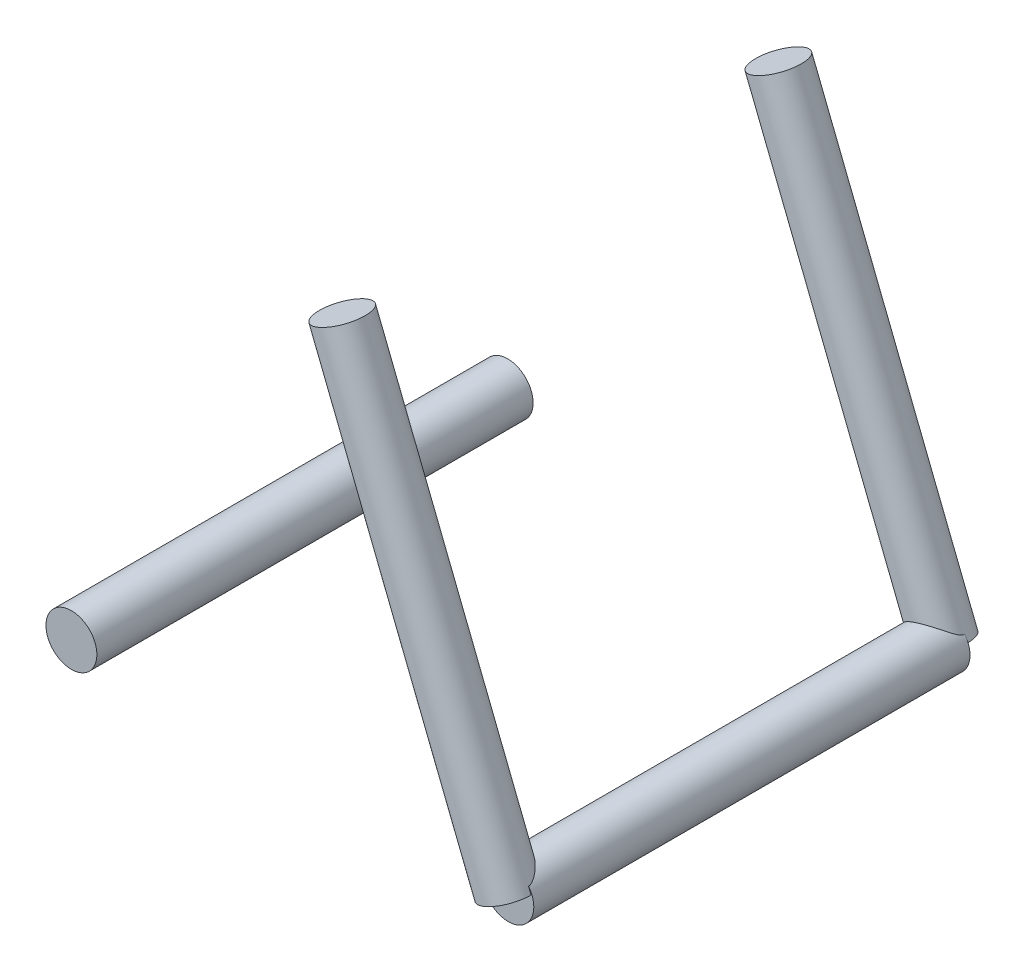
ISO-10303-21;
HEADER;
FILE_DESCRIPTION(('STEP AP214'),'2;1');
FILE_NAME('part.step','',(''),(''),'','','');
FILE_SCHEMA(('AUTOMOTIVE_DESIGN { 1 0 10303 214 1 1 1 1 }'));
ENDSEC;
DATA;
#1=APPLICATION_CONTEXT('core data for automotive mechanical design processes');
#2=APPLICATION_PROTOCOL_DEFINITION('international standard','automotive_design',2000,#1);
#3=PRODUCT_CONTEXT('',#1,'mechanical');
#4=PRODUCT('Part','Part','',(#3));
#5=PRODUCT_RELATED_PRODUCT_CATEGORY('part','',(#4));
#6=PRODUCT_DEFINITION_FORMATION('','',#4);
#7=PRODUCT_DEFINITION_CONTEXT('part definition',#1,'design');
#8=PRODUCT_DEFINITION('design','',#6,#7);
#9=PRODUCT_DEFINITION_SHAPE('','',#8);
#10=(LENGTH_UNIT() NAMED_UNIT(*) SI_UNIT(.MILLI.,.METRE.));
#11=(NAMED_UNIT(*) PLANE_ANGLE_UNIT() SI_UNIT($,.RADIAN.));
#12=(NAMED_UNIT(*) SI_UNIT($,.STERADIAN.) SOLID_ANGLE_UNIT());
#13=UNCERTAINTY_MEASURE_WITH_UNIT(LENGTH_MEASURE(1.E-05),#10,'distance_accuracy_value','');
#14=(GEOMETRIC_REPRESENTATION_CONTEXT(3) GLOBAL_UNCERTAINTY_ASSIGNED_CONTEXT((#13)) GLOBAL_UNIT_ASSIGNED_CONTEXT((#10,
#11,#12)) REPRESENTATION_CONTEXT('',''));
#15=CARTESIAN_POINT('',(0.,0.,0.));
#16=DIRECTION('',(0.,0.,1.));
#17=DIRECTION('',(1.,0.,0.));
#18=AXIS2_PLACEMENT_3D('',#15,#16,#17);
#19=CARTESIAN_POINT('',(-125.189240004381,0.,124.995716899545));
#20=DIRECTION('',(0.,0.,-1.));
#21=DIRECTION('',(-1.,0.,0.));
#22=AXIS2_PLACEMENT_3D('',#19,#20,#21);
#23=CYLINDRICAL_SURFACE('',#22,7.29632742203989);
#24=CARTESIAN_POINT('',(-125.189240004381,0.,124.995716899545));
#25=DIRECTION('',(0.,0.,1.));
#26=DIRECTION('',(1.,0.,0.));
#27=AXIS2_PLACEMENT_3D('',#24,#25,#26);
#28=CIRCLE('',#27,7.29632742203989);
#29=CARTESIAN_POINT('',(-117.892912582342,0.,124.995716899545));
#30=VERTEX_POINT('',#29);
#31=EDGE_CURVE('E11',#30,#30,#28,.T.);
#32=ORIENTED_EDGE('',*,*,#31,.F.);
#33=EDGE_LOOP('',(#32));
#34=FACE_BOUND('',#33,.T.);
#35=CARTESIAN_POINT('',(-125.189240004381,0.,0.));
#36=DIRECTION('',(0.,0.,1.));
#37=DIRECTION('',(1.,0.,0.));
#38=AXIS2_PLACEMENT_3D('',#35,#36,#37);
#39=CIRCLE('',#38,7.29632742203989);
#40=CARTESIAN_POINT('',(-117.892912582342,0.,0.));
#41=VERTEX_POINT('',#40);
#42=EDGE_CURVE('E42',#41,#41,#39,.T.);
#43=ORIENTED_EDGE('',*,*,#42,.T.);
#44=EDGE_LOOP('',(#43));
#45=FACE_BOUND('',#44,.T.);
#46=ADVANCED_FACE('F39',(#34,#45),#23,.T.);
#47=CARTESIAN_POINT('',(-125.189240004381,0.,124.995716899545));
#48=DIRECTION('',(0.,0.,1.));
#49=DIRECTION('',(1.,0.,0.));
#50=AXIS2_PLACEMENT_3D('',#47,#48,#49);
#51=PLANE('',#50);
#52=ORIENTED_EDGE('',*,*,#31,.T.);
#53=EDGE_LOOP('',(#52));
#54=FACE_BOUND('',#53,.T.);
#55=ADVANCED_FACE('F54',(#54),#51,.T.);
#56=CARTESIAN_POINT('',(-125.189240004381,0.,0.));
#57=DIRECTION('',(0.,0.,1.));
#58=DIRECTION('',(1.,0.,0.));
#59=AXIS2_PLACEMENT_3D('',#56,#57,#58);
#60=PLANE('',#59);
#61=ORIENTED_EDGE('',*,*,#42,.F.);
#62=EDGE_LOOP('',(#61));
#63=FACE_BOUND('',#62,.T.);
#64=ADVANCED_FACE('F52',(#63),#60,.F.);
#65=CLOSED_SHELL('',(#46,#55,#64));
#66=MANIFOLD_SOLID_BREP('B2',#65);
#67=CARTESIAN_POINT('',(0.,0.,124.995716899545));
#68=DIRECTION('',(-0.369030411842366,0.929417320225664,0.));
#69=DIRECTION('',(-0.929417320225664,-0.369030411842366,0.));
#70=AXIS2_PLACEMENT_3D('',#67,#68,#69);
#71=CYLINDRICAL_SURFACE('',#70,7.01873447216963);
#72=CARTESIAN_POINT('',(0.,0.,124.995716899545));
#73=DIRECTION('',(0.369030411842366,-0.929417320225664,0.));
#74=DIRECTION('',(0.929417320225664,0.369030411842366,0.));
#75=AXIS2_PLACEMENT_3D('',#72,#73,#74);
#76=CIRCLE('',#75,7.01873447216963);
#77=CARTESIAN_POINT('',(-6.52333338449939,-2.59012647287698,124.995716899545));
#78=VERTEX_POINT('',#77);
#79=EDGE_CURVE('E38',#78,#78,#76,.T.);
#80=CARTESIAN_POINT('',(-47.6155153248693,119.921511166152,124.995716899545));
#81=DIRECTION('',(0.369030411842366,-0.929417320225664,0.));
#82=DIRECTION('',(0.929417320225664,0.369030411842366,0.));
#83=AXIS2_PLACEMENT_3D('',#80,#81,#82);
#84=CIRCLE('',#83,7.01873447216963);
#85=CARTESIAN_POINT('',(-54.1388487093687,117.331384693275,124.995716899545));
#86=VERTEX_POINT('',#85);
#87=EDGE_CURVE('E91',#86,#86,#84,.T.);
#88=CARTESIAN_POINT('',(-6.52333338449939,-2.59012647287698,124.995716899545));
#89=CARTESIAN_POINT('',(-7.01932833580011,-1.34094406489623,124.995716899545));
#90=CARTESIAN_POINT('',(-7.51532328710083,-0.0917616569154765,124.995716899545));
#91=CARTESIAN_POINT('',(-8.50731318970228,2.40660315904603,124.995716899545));
#92=CARTESIAN_POINT('',(-9.003308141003,3.65578556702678,124.995716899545));
#93=CARTESIAN_POINT('',(-9.99529804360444,6.15415038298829,124.995716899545));
#94=CARTESIAN_POINT('',(-10.4912929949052,7.40333279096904,124.995716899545));
#95=CARTESIAN_POINT('',(-11.4832828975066,9.90169760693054,124.995716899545));
#96=CARTESIAN_POINT('',(-11.9792778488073,11.1508800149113,124.995716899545));
#97=CARTESIAN_POINT('',(-12.9712677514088,13.6492448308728,124.995716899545));
#98=CARTESIAN_POINT('',(-13.4672627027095,14.8984272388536,124.995716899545));
#99=CARTESIAN_POINT('',(-14.4592526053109,17.3967920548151,124.995716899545));
#100=CARTESIAN_POINT('',(-14.9552475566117,18.6459744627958,124.995716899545));
#101=CARTESIAN_POINT('',(-15.9472374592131,21.1443392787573,124.995716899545));
#102=CARTESIAN_POINT('',(-16.4432324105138,22.3935216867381,124.995716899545));
#103=CARTESIAN_POINT('',(-17.4352223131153,24.8918865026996,124.995716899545));
#104=CARTESIAN_POINT('',(-17.931217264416,26.1410689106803,124.995716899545));
#105=CARTESIAN_POINT('',(-18.9232071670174,28.6394337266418,124.995716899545));
#106=CARTESIAN_POINT('',(-19.4192021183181,29.8886161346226,124.995716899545));
#107=CARTESIAN_POINT('',(-20.4111920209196,32.3869809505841,124.995716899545));
#108=CARTESIAN_POINT('',(-20.9071869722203,33.6361633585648,124.995716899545));
#109=CARTESIAN_POINT('',(-21.8991768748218,36.1345281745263,124.995716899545));
#110=CARTESIAN_POINT('',(-22.3951718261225,37.3837105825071,124.995716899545));
#111=CARTESIAN_POINT('',(-23.3871617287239,39.8820753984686,124.995716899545));
#112=CARTESIAN_POINT('',(-23.8831566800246,41.1312578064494,124.995716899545));
#113=CARTESIAN_POINT('',(-24.8751465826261,43.6296226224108,124.995716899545));
#114=CARTESIAN_POINT('',(-25.3711415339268,44.8788050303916,124.995716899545));
#115=CARTESIAN_POINT('',(-26.3631314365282,47.3771698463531,124.995716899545));
#116=CARTESIAN_POINT('',(-26.859126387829,48.6263522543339,124.995716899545));
#117=CARTESIAN_POINT('',(-27.8511162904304,51.1247170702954,124.995716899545));
#118=CARTESIAN_POINT('',(-28.3471112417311,52.3738994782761,124.995716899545));
#119=CARTESIAN_POINT('',(-29.3391011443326,54.8722642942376,124.995716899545));
#120=CARTESIAN_POINT('',(-29.8350960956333,56.1214467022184,124.995716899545));
#121=CARTESIAN_POINT('',(-30.8270859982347,58.6198115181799,124.995716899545));
#122=CARTESIAN_POINT('',(-31.3230809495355,59.8689939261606,124.995716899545));
#123=CARTESIAN_POINT('',(-32.3150708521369,62.3673587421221,124.995716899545));
#124=CARTESIAN_POINT('',(-32.8110658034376,63.6165411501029,124.995716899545));
#125=CARTESIAN_POINT('',(-33.8030557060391,66.1149059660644,124.995716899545));
#126=CARTESIAN_POINT('',(-34.2990506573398,67.3640883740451,124.995716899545));
#127=CARTESIAN_POINT('',(-35.2910405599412,69.8624531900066,124.995716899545));
#128=CARTESIAN_POINT('',(-35.787035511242,71.1116355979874,124.995716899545));
#129=CARTESIAN_POINT('',(-36.7790254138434,73.6100004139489,124.995716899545));
#130=CARTESIAN_POINT('',(-37.2750203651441,74.8591828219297,124.995716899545));
#131=CARTESIAN_POINT('',(-38.2670102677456,77.3575476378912,124.995716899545));
#132=CARTESIAN_POINT('',(-38.7630052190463,78.6067300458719,124.995716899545));
#133=CARTESIAN_POINT('',(-39.7549951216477,81.1050948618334,124.995716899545));
#134=CARTESIAN_POINT('',(-40.2509900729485,82.3542772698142,124.995716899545));
#135=CARTESIAN_POINT('',(-41.2429799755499,84.8526420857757,124.995716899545));
#136=CARTESIAN_POINT('',(-41.7389749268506,86.1018244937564,124.995716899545));
#137=CARTESIAN_POINT('',(-42.730964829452,88.6001893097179,124.995716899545));
#138=CARTESIAN_POINT('',(-43.2269597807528,89.8493717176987,124.995716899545));
#139=CARTESIAN_POINT('',(-44.2189496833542,92.3477365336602,124.995716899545));
#140=CARTESIAN_POINT('',(-44.7149446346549,93.5969189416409,124.995716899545));
#141=CARTESIAN_POINT('',(-45.7069345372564,96.0952837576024,124.995716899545));
#142=CARTESIAN_POINT('',(-46.2029294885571,97.3444661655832,124.995716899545));
#143=CARTESIAN_POINT('',(-47.1949193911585,99.8428309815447,124.995716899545));
#144=CARTESIAN_POINT('',(-47.6909143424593,101.092013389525,124.995716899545));
#145=CARTESIAN_POINT('',(-48.6829042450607,103.590378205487,124.995716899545));
#146=CARTESIAN_POINT('',(-49.1788991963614,104.839560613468,124.995716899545));
#147=CARTESIAN_POINT('',(-50.1708890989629,107.337925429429,124.995716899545));
#148=CARTESIAN_POINT('',(-50.6668840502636,108.58710783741,124.995716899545));
#149=CARTESIAN_POINT('',(-51.658873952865,111.085472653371,124.995716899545));
#150=CARTESIAN_POINT('',(-52.1548689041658,112.334655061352,124.995716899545));
#151=CARTESIAN_POINT('',(-53.1468588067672,114.833019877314,124.995716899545));
#152=CARTESIAN_POINT('',(-53.6428537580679,116.082202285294,124.995716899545));
#153=CARTESIAN_POINT('',(-54.1388487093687,117.331384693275,124.995716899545));
#154=B_SPLINE_CURVE_WITH_KNOTS('',3,(#88,#89,#90,#91,#92,#93,#94,#95,#96,#97,#98,#99,#100,#101,
#102,#103,#104,#105,#106,#107,#108,#109,#110,#111,#112,#113,#114,#115,#116,#117,#118,#119,#120,
#121,#122,#123,#124,#125,#126,#127,#128,#129,#130,#131,#132,#133,#134,#135,#136,#137,#138,#139,
#140,#141,#142,#143,#144,#145,#146,#147,#148,#149,#150,#151,#152,#153),.UNSPECIFIED.,.F.,.F.,(4,
2,2,2,2,2,2,2,2,2,2,2,2,2,2,2,2,2,2,2,2,2,2,2,2,2,2,2,2,2,2,2,4),(0.,4.03214696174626,
8.06429392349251,12.0964408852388,16.128587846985,20.1607348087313,24.1928817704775,
28.2250287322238,32.25717569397,36.2893226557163,40.3214696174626,44.3536165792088,
48.3857635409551,52.4179105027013,56.4500574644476,60.4822044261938,64.5143513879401,
68.5464983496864,72.5786453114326,76.6107922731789,80.6429392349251,84.6750861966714,
88.7072331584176,92.7393801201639,96.7715270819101,100.803674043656,104.835821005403,
108.867967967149,112.900114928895,116.932261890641,120.964408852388,124.996555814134,
129.02870277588),.UNSPECIFIED.);
#155=EDGE_CURVE('BSEAM88',#78,#86,#154,.T.);
#156=ORIENTED_EDGE('',*,*,#79,.F.);
#157=ORIENTED_EDGE('',*,*,#87,.T.);
#158=ORIENTED_EDGE('',*,*,#155,.T.);
#159=ORIENTED_EDGE('',*,*,#155,.F.);
#160=EDGE_LOOP('',(#156,#158,#157,#159));
#161=FACE_BOUND('',#160,.T.);
#162=ADVANCED_FACE('F88',(#161),#71,.T.);
#163=CARTESIAN_POINT('',(0.,0.,124.995716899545));
#164=DIRECTION('',(0.369030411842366,-0.929417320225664,0.));
#165=DIRECTION('',(0.929417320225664,0.369030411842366,0.));
#166=AXIS2_PLACEMENT_3D('',#163,#164,#165);
#167=PLANE('',#166);
#168=ORIENTED_EDGE('',*,*,#79,.T.);
#169=EDGE_LOOP('',(#168));
#170=FACE_BOUND('',#169,.T.);
#171=ADVANCED_FACE('F103',(#170),#167,.T.);
#172=CARTESIAN_POINT('',(-47.6155153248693,119.921511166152,124.995716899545));
#173=DIRECTION('',(0.369030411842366,-0.929417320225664,0.));
#174=DIRECTION('',(0.929417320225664,0.369030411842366,0.));
#175=AXIS2_PLACEMENT_3D('',#172,#173,#174);
#176=PLANE('',#175);
#177=ORIENTED_EDGE('',*,*,#87,.F.);
#178=EDGE_LOOP('',(#177));
#179=FACE_BOUND('',#178,.T.);
#180=ADVANCED_FACE('F101',(#179),#176,.F.);
#181=CLOSED_SHELL('',(#162,#171,#180));
#182=MANIFOLD_SOLID_BREP('B6',#181);
#183=CARTESIAN_POINT('',(0.,0.,0.));
#184=DIRECTION('',(-0.369030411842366,0.929417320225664,0.));
#185=DIRECTION('',(-0.929417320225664,-0.369030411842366,0.));
#186=AXIS2_PLACEMENT_3D('',#183,#184,#185);
#187=CYLINDRICAL_SURFACE('',#186,7.01873447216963);
#188=CARTESIAN_POINT('',(-47.6155153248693,119.921511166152,0.));
#189=DIRECTION('',(0.369030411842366,-0.929417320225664,0.));
#190=DIRECTION('',(0.929417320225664,0.369030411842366,0.));
#191=AXIS2_PLACEMENT_3D('',#188,#189,#190);
#192=CIRCLE('',#191,7.01873447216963);
#193=CARTESIAN_POINT('',(-41.0921819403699,122.511637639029,0.));
#194=VERTEX_POINT('',#193);
#195=EDGE_CURVE('E163',#194,#194,#192,.T.);
#196=ORIENTED_EDGE('',*,*,#195,.T.);
#197=EDGE_LOOP('',(#196));
#198=FACE_BOUND('',#197,.T.);
#199=DIRECTION('',(-0.369030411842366,0.929417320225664,0.));
#200=VECTOR('',#199,1.);
#201=CARTESIAN_POINT('',(6.52333338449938,2.59012647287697,0.));
#202=LINE('',#201,#200);
#203=CARTESIAN_POINT('',(6.52333338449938,2.59012647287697,0.));
#204=VERTEX_POINT('',#203);
#205=CARTESIAN_POINT('',(5.78769735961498,4.44285416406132,0.));
#206=VERTEX_POINT('',#205);
#207=EDGE_CURVE('E155',#204,#206,#202,.T.);
#208=ORIENTED_EDGE('',*,*,#207,.F.);
#209=CARTESIAN_POINT('',(0.,0.,0.));
#210=DIRECTION('',(0.369030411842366,-0.929417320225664,0.));
#211=DIRECTION('',(0.929417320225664,0.369030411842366,0.));
#212=AXIS2_PLACEMENT_3D('',#209,#210,#211);
#213=CIRCLE('',#212,7.01873447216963);
#214=CARTESIAN_POINT('',(-6.52333338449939,-2.59012647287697,0.));
#215=VERTEX_POINT('',#214);
#216=EDGE_CURVE('E169',#215,#204,#213,.T.);
#217=ORIENTED_EDGE('',*,*,#216,.F.);
#218=DIRECTION('',(-0.369030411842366,0.929417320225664,0.));
#219=VECTOR('',#218,1.);
#220=CARTESIAN_POINT('',(-6.52333338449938,-2.59012647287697,0.));
#221=LINE('',#220,#219);
#222=CARTESIAN_POINT('',(-7.25896940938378,-0.737398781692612,0.));
#223=VERTEX_POINT('',#222);
#224=EDGE_CURVE('E147',#223,#215,#221,.F.);
#225=ORIENTED_EDGE('',*,*,#224,.F.);
#226=CARTESIAN_POINT('',(5.78769735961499,4.44285416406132,0.));
#227=CARTESIAN_POINT('',(5.78773313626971,4.44279348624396,0.0659255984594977));
#228=CARTESIAN_POINT('',(5.78562819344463,4.44554982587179,0.131802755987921));
#229=CARTESIAN_POINT('',(5.77742754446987,4.45620939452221,0.262708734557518));
#230=CARTESIAN_POINT('',(5.77134313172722,4.46409805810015,0.327739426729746));
#231=CARTESIAN_POINT('',(5.75562560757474,4.48434133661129,0.455326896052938));
#232=CARTESIAN_POINT('',(5.74606382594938,4.49660609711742,0.51790718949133));
#233=CARTESIAN_POINT('',(5.72377690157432,4.52494194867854,0.641655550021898));
#234=CARTESIAN_POINT('',(5.71104933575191,4.54101595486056,0.702822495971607));
#235=CARTESIAN_POINT('',(5.67369642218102,4.58769395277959,0.862725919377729));
#236=CARTESIAN_POINT('',(5.64670510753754,4.6209646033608,0.960128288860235));
#237=CARTESIAN_POINT('',(5.58679935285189,4.69321560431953,1.15088719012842));
#238=CARTESIAN_POINT('',(5.55388038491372,4.73220031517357,1.2442405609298));
#239=CARTESIAN_POINT('',(5.48282442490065,4.81435523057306,1.42850362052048));
#240=CARTESIAN_POINT('',(5.44462994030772,4.85756976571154,1.51937094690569));
#241=CARTESIAN_POINT('',(5.36409671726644,4.94635819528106,1.69808941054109));
#242=CARTESIAN_POINT('',(5.32175625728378,4.99193306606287,1.78593927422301));
#243=CARTESIAN_POINT('',(5.22542851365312,5.09283776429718,1.97484275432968));
#244=CARTESIAN_POINT('',(5.17072436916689,5.14843269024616,2.07538764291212));
#245=CARTESIAN_POINT('',(5.05683160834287,5.26034601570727,2.27350131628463));
#246=CARTESIAN_POINT('',(4.99764201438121,5.31666457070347,2.37106944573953));
#247=CARTESIAN_POINT('',(4.81382752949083,5.48553432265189,2.66009367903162));
#248=CARTESIAN_POINT('',(4.68302354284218,5.59792865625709,2.84774227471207));
#249=CARTESIAN_POINT('',(4.40699590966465,5.81772382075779,3.21410201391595));
#250=CARTESIAN_POINT('',(4.26181419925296,5.92513790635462,3.39283698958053));
#251=CARTESIAN_POINT('',(3.95746556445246,6.13259884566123,3.74236770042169));
#252=CARTESIAN_POINT('',(3.79830481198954,6.23264891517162,3.91316688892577));
#253=CARTESIAN_POINT('',(3.47402982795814,6.41878593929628,4.23889183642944));
#254=CARTESIAN_POINT('',(3.30953768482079,6.50530609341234,4.39418639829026));
#255=CARTESIAN_POINT('',(2.96839938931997,6.66788947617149,4.69664789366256));
#256=CARTESIAN_POINT('',(2.79175114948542,6.74395090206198,4.84381342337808));
#257=CARTESIAN_POINT('',(2.24421146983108,6.9535864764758,5.27126820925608));
#258=CARTESIAN_POINT('',(1.85507898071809,7.06899671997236,5.53817103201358));
#259=CARTESIAN_POINT('',(1.14455159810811,7.21248191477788,5.95657509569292));
#260=CARTESIAN_POINT('',(0.833174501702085,7.25571327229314,6.11978978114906));
#261=CARTESIAN_POINT('',(0.3524868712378,7.28957947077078,6.33896920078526));
#262=CARTESIAN_POINT('',(0.190016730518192,7.29570635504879,6.40774551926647));
#263=CARTESIAN_POINT('',(-0.13869903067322,7.2968582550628,6.53579593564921));
#264=CARTESIAN_POINT('',(-0.304944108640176,7.2918848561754,6.59507138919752));
#265=CARTESIAN_POINT('',(-0.614913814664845,7.27177087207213,6.69497342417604));
#266=CARTESIAN_POINT('',(-0.758274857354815,7.25826775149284,6.73706367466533));
#267=CARTESIAN_POINT('',(-1.04605645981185,7.22240778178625,6.81302381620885));
#268=CARTESIAN_POINT('',(-1.19047682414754,7.20005252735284,6.84689518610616));
#269=CARTESIAN_POINT('',(-1.47937724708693,7.14628688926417,6.90586959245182));
#270=CARTESIAN_POINT('',(-1.6238572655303,7.11487976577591,6.93097577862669));
#271=CARTESIAN_POINT('',(-1.91186246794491,7.04295415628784,6.97199890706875));
#272=CARTESIAN_POINT('',(-2.05538764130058,7.00243556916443,6.98791574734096));
#273=CARTESIAN_POINT('',(-2.34078946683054,6.91227615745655,7.01029805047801));
#274=CARTESIAN_POINT('',(-2.48265967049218,6.86260758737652,7.01673421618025));
#275=CARTESIAN_POINT('',(-2.76315265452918,6.75455175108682,7.01993757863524));
#276=CARTESIAN_POINT('',(-2.90177543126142,6.69616447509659,7.01670476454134));
#277=CARTESIAN_POINT('',(-3.17469952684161,6.57116485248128,7.00063208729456));
#278=CARTESIAN_POINT('',(-3.30900043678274,6.50455173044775,6.98779131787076));
#279=CARTESIAN_POINT('',(-3.57229656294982,6.36375534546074,6.95274612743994));
#280=CARTESIAN_POINT('',(-3.70129182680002,6.28957215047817,6.93054179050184));
#281=CARTESIAN_POINT('',(-3.94734376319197,6.13797773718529,6.87840157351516));
#282=CARTESIAN_POINT('',(-4.06467666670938,6.06087461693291,6.84887088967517));
#283=CARTESIAN_POINT('',(-4.29326610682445,5.90116400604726,6.78210464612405));
#284=CARTESIAN_POINT('',(-4.40452033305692,5.81855444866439,6.74486618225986));
#285=CARTESIAN_POINT('',(-4.72848988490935,5.56355421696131,6.62233779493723));
#286=CARTESIAN_POINT('',(-4.93157302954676,5.38389170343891,6.52619976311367));
#287=CARTESIAN_POINT('',(-5.25217976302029,5.06805534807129,6.34271122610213));
#288=CARTESIAN_POINT('',(-5.37690347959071,4.93533699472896,6.26162861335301));
#289=CARTESIAN_POINT('',(-5.61313752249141,4.66490123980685,6.08911604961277));
#290=CARTESIAN_POINT('',(-5.72464366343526,4.52718227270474,5.99768283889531));
#291=CARTESIAN_POINT('',(-6.04003305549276,4.10812827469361,5.70944456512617));
#292=CARTESIAN_POINT('',(-6.2243988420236,3.82128833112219,5.49893150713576));
#293=CARTESIAN_POINT('',(-6.49348642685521,3.33495950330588,5.12188000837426));
#294=CARTESIAN_POINT('',(-6.59125414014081,3.13668353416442,4.96263057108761));
#295=CARTESIAN_POINT('',(-6.76581882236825,2.73989516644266,4.633046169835));
#296=CARTESIAN_POINT('',(-6.84260624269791,2.54138270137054,4.46270620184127));
#297=CARTESIAN_POINT('',(-6.97650677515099,2.14665429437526,4.1126260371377));
#298=CARTESIAN_POINT('',(-7.03364822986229,1.95043544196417,3.93289981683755));
#299=CARTESIAN_POINT('',(-7.12992352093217,1.56222888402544,3.56449087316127));
#300=CARTESIAN_POINT('',(-7.16906455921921,1.37023951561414,3.3758117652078));
#301=CARTESIAN_POINT('',(-7.2318455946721,0.987595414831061,2.9835757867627));
#302=CARTESIAN_POINT('',(-7.25500612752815,0.79713876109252,2.77974680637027));
#303=CARTESIAN_POINT('',(-7.27835459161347,0.520209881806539,2.46486663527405));
#304=CARTESIAN_POINT('',(-7.28423895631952,0.429202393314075,2.35818176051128));
#305=CARTESIAN_POINT('',(-7.29254218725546,0.251258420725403,2.14132792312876));
#306=CARTESIAN_POINT('',(-7.29496149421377,0.164321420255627,2.03115940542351));
#307=CARTESIAN_POINT('',(-7.29661232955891,0.0142140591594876,1.83085986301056));
#308=CARTESIAN_POINT('',(-7.29641965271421,-0.0500330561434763,1.74154217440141));
#309=CARTESIAN_POINT('',(-7.29451572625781,-0.173976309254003,1.55982844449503));
#310=CARTESIAN_POINT('',(-7.29280494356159,-0.233673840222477,1.46743335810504));
#311=CARTESIAN_POINT('',(-7.28831761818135,-0.346361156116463,1.27989679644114));
#312=CARTESIAN_POINT('',(-7.28555200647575,-0.399412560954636,1.18479245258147));
#313=CARTESIAN_POINT('',(-7.27953188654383,-0.497195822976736,0.990388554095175));
#314=CARTESIAN_POINT('',(-7.2762777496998,-0.541933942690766,0.891092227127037));
#315=CARTESIAN_POINT('',(-7.27125286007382,-0.604864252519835,0.727209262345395));
#316=CARTESIAN_POINT('',(-7.26939404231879,-0.626639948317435,0.664005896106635));
#317=CARTESIAN_POINT('',(-7.2659878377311,-0.664967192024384,0.5360594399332));
#318=CARTESIAN_POINT('',(-7.26444018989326,-0.681523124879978,0.471317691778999));
#319=CARTESIAN_POINT('',(-7.26183074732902,-0.708810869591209,0.339314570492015));
#320=CARTESIAN_POINT('',(-7.26077860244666,-0.719427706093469,0.272028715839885));
#321=CARTESIAN_POINT('',(-7.25933804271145,-0.733771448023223,0.136515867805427));
#322=CARTESIAN_POINT('',(-7.25895171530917,-0.737476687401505,0.0682865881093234));
#323=CARTESIAN_POINT('',(-7.25896940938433,-0.737398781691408,-4.80961841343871E-13));
#324=B_SPLINE_CURVE_WITH_KNOTS('',3,(#226,#227,#228,#229,#230,#231,#232,#233,#234,#235,#236,
#237,#238,#239,#240,#241,#242,#243,#244,#245,#246,#247,#248,#249,#250,#251,#252,#253,#254,#255,
#256,#257,#258,#259,#260,#261,#262,#263,#264,#265,#266,#267,#268,#269,#270,#271,#272,#273,#274,
#275,#276,#277,#278,#279,#280,#281,#282,#283,#284,#285,#286,#287,#288,#289,#290,#291,#292,#293,
#294,#295,#296,#297,#298,#299,#300,#301,#302,#303,#304,#305,#306,#307,#308,#309,#310,#311,#312,
#313,#314,#315,#316,#317,#318,#319,#320,#321,#322,#323),.UNSPECIFIED.,.F.,.F.,(4,2,2,2,2,2,2,2,
2,2,2,2,2,2,2,2,2,2,2,2,2,2,2,2,2,2,2,2,2,2,2,2,2,2,2,2,2,2,2,2,2,2,2,2,2,2,2,2,4),(0.,
0.197608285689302,0.394658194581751,0.587875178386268,0.781240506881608,1.09988300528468,
1.41876994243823,1.74145592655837,2.06427647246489,2.44588253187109,2.82757200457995,
3.59143046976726,4.35312314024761,5.11448118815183,5.84039552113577,6.56643482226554,
8.01555075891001,9.07402497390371,9.60307833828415,10.1320561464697,10.581665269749,
11.0311934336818,11.4805598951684,11.9299313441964,12.3806885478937,12.8314462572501,
13.2822464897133,13.7330426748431,14.1629841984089,14.5930880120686,15.4527230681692,
16.0500858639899,16.6476373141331,17.8445125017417,18.6609810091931,19.4778204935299,
20.2934765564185,21.1088059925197,21.9476430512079,22.3685927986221,22.789488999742,
23.1194500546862,23.4493096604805,23.7758399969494,24.1021233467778,24.3025667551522,
24.5028413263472,24.7068695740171,24.9115363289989),.UNSPECIFIED.);
#325=EDGE_CURVE('E86',#206,#223,#324,.T.);
#326=ORIENTED_EDGE('',*,*,#325,.F.);
#327=EDGE_LOOP('',(#208,#217,#225,#326));
#328=FACE_BOUND('',#327,.T.);
#329=ADVANCED_FACE('F128',(#198,#328),#187,.T.);
#330=CARTESIAN_POINT('',(0.,0.,0.));
#331=DIRECTION('',(0.369030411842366,-0.929417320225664,0.));
#332=DIRECTION('',(0.929417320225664,0.369030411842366,0.));
#333=AXIS2_PLACEMENT_3D('',#330,#331,#332);
#334=PLANE('',#333);
#335=ORIENTED_EDGE('',*,*,#216,.T.);
#336=DIRECTION('',(-0.929417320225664,-0.369030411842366,0.));
#337=VECTOR('',#336,1.);
#338=CARTESIAN_POINT('',(0.,0.,0.));
#339=LINE('',#338,#337);
#340=EDGE_CURVE('E140',#204,#215,#339,.T.);
#341=ORIENTED_EDGE('',*,*,#340,.T.);
#342=EDGE_LOOP('',(#335,#341));
#343=FACE_BOUND('',#342,.T.);
#344=ADVANCED_FACE('F177',(#343),#334,.T.);
#345=CARTESIAN_POINT('',(-47.6155153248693,119.921511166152,0.));
#346=DIRECTION('',(0.369030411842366,-0.929417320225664,0.));
#347=DIRECTION('',(0.929417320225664,0.369030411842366,0.));
#348=AXIS2_PLACEMENT_3D('',#345,#346,#347);
#349=PLANE('',#348);
#350=ORIENTED_EDGE('',*,*,#195,.F.);
#351=EDGE_LOOP('',(#350));
#352=FACE_BOUND('',#351,.T.);
#353=ADVANCED_FACE('F179',(#352),#349,.F.);
#354=CARTESIAN_POINT('',(0.,0.,124.995716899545));
#355=DIRECTION('',(0.,0.,-1.));
#356=DIRECTION('',(-1.,0.,0.));
#357=AXIS2_PLACEMENT_3D('',#354,#355,#356);
#358=CYLINDRICAL_SURFACE('',#357,7.29632742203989);
#359=CARTESIAN_POINT('',(0.,0.,124.995716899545));
#360=DIRECTION('',(0.,0.,1.));
#361=DIRECTION('',(1.,0.,0.));
#362=AXIS2_PLACEMENT_3D('',#359,#360,#361);
#363=CIRCLE('',#362,7.29632742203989);
#364=CARTESIAN_POINT('',(7.29632742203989,0.,124.995716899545));
#365=VERTEX_POINT('',#364);
#366=EDGE_CURVE('E167',#365,#365,#363,.T.);
#367=ORIENTED_EDGE('',*,*,#366,.F.);
#368=EDGE_LOOP('',(#367));
#369=FACE_BOUND('',#368,.T.);
#370=CARTESIAN_POINT('',(0.,0.,0.));
#371=DIRECTION('',(0.,0.,1.));
#372=DIRECTION('',(1.,0.,0.));
#373=AXIS2_PLACEMENT_3D('',#370,#371,#372);
#374=CIRCLE('',#373,7.29632742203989);
#375=EDGE_CURVE('E158',#223,#206,#374,.T.);
#376=ORIENTED_EDGE('',*,*,#375,.T.);
#377=ORIENTED_EDGE('',*,*,#325,.T.);
#378=EDGE_LOOP('',(#376,#377));
#379=FACE_BOUND('',#378,.T.);
#380=ADVANCED_FACE('F166',(#369,#379),#358,.T.);
#381=CARTESIAN_POINT('',(0.,0.,0.));
#382=DIRECTION('',(0.,0.,1.));
#383=DIRECTION('',(1.,0.,0.));
#384=AXIS2_PLACEMENT_3D('',#381,#382,#383);
#385=PLANE('',#384);
#386=ORIENTED_EDGE('',*,*,#340,.F.);
#387=ORIENTED_EDGE('',*,*,#207,.T.);
#388=ORIENTED_EDGE('',*,*,#375,.F.);
#389=ORIENTED_EDGE('',*,*,#224,.T.);
#390=EDGE_LOOP('',(#386,#387,#388,#389));
#391=FACE_BOUND('',#390,.T.);
#392=ADVANCED_FACE('F157',(#391),#385,.F.);
#393=CARTESIAN_POINT('',(0.,0.,124.995716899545));
#394=DIRECTION('',(0.,0.,1.));
#395=DIRECTION('',(1.,0.,0.));
#396=AXIS2_PLACEMENT_3D('',#393,#394,#395);
#397=PLANE('',#396);
#398=ORIENTED_EDGE('',*,*,#366,.T.);
#399=EDGE_LOOP('',(#398));
#400=FACE_BOUND('',#399,.T.);
#401=ADVANCED_FACE('F193',(#400),#397,.T.);
#402=CLOSED_SHELL('',(#329,#344,#353,#380,#392,#401));
#403=MANIFOLD_SOLID_BREP('B33',#402);
#404=ADVANCED_BREP_SHAPE_REPRESENTATION('',(#18,#66,#182,#403),#14);
#405=SHAPE_DEFINITION_REPRESENTATION(#9,#404);
ENDSEC;
END-ISO-10303-21;
